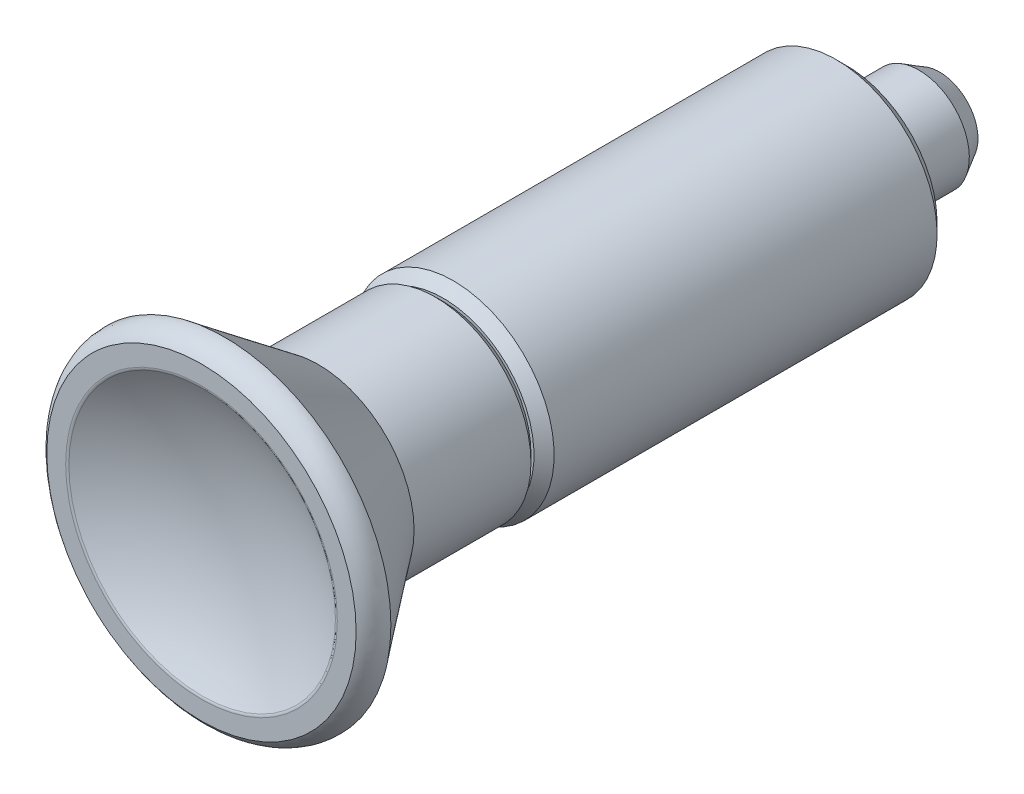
ISO-10303-21;
HEADER;
FILE_DESCRIPTION(('STEP AP214'),'2;1');
FILE_NAME('part.step','',(''),(''),'','','');
FILE_SCHEMA(('AUTOMOTIVE_DESIGN { 1 0 10303 214 1 1 1 1 }'));
ENDSEC;
DATA;
#1=APPLICATION_CONTEXT('core data for automotive mechanical design processes');
#2=APPLICATION_PROTOCOL_DEFINITION('international standard','automotive_design',2000,#1);
#3=PRODUCT_CONTEXT('',#1,'mechanical');
#4=PRODUCT('Part','Part','',(#3));
#5=PRODUCT_RELATED_PRODUCT_CATEGORY('part','',(#4));
#6=PRODUCT_DEFINITION_FORMATION('','',#4);
#7=PRODUCT_DEFINITION_CONTEXT('part definition',#1,'design');
#8=PRODUCT_DEFINITION('design','',#6,#7);
#9=PRODUCT_DEFINITION_SHAPE('','',#8);
#10=(LENGTH_UNIT() NAMED_UNIT(*) SI_UNIT(.MILLI.,.METRE.));
#11=(NAMED_UNIT(*) PLANE_ANGLE_UNIT() SI_UNIT($,.RADIAN.));
#12=(NAMED_UNIT(*) SI_UNIT($,.STERADIAN.) SOLID_ANGLE_UNIT());
#13=UNCERTAINTY_MEASURE_WITH_UNIT(LENGTH_MEASURE(1.E-05),#10,'distance_accuracy_value','');
#14=(GEOMETRIC_REPRESENTATION_CONTEXT(3) GLOBAL_UNCERTAINTY_ASSIGNED_CONTEXT((#13)) GLOBAL_UNIT_ASSIGNED_CONTEXT((#10,
#11,#12)) REPRESENTATION_CONTEXT('',''));
#15=CARTESIAN_POINT('',(0.,0.,0.));
#16=DIRECTION('',(0.,0.,1.));
#17=DIRECTION('',(1.,0.,0.));
#18=AXIS2_PLACEMENT_3D('',#15,#16,#17);
#19=CARTESIAN_POINT('',(3.05742424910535E-10,5.05678832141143E-10,-8.26498591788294E-10));
#20=DIRECTION('',(-0.923728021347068,-0.383049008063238,0.));
#21=DIRECTION('',(0.,0.,-1.));
#22=AXIS2_PLACEMENT_3D('',#19,#20,#21);
#23=SPHERICAL_SURFACE('',#22,10.);
#24=CARTESIAN_POINT('',(0.,0.,-9.24093444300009));
#25=DIRECTION('',(0.,0.,1.));
#26=DIRECTION('',(0.923728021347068,0.383049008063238,0.));
#27=AXIS2_PLACEMENT_3D('',#24,#25,#26);
#28=CIRCLE('',#27,3.82166595);
#29=CARTESIAN_POINT('',(3.53017992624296,1.46388535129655,-9.24093444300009));
#30=VERTEX_POINT('',#29);
#31=EDGE_CURVE('E39',#30,#30,#28,.T.);
#32=ORIENTED_EDGE('',*,*,#31,.F.);
#33=EDGE_LOOP('',(#32));
#34=FACE_BOUND('',#33,.T.);
#35=ADVANCED_FACE('F12',(#34),#23,.T.);
#36=CARTESIAN_POINT('',(0.,0.,-9.24093444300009));
#37=DIRECTION('',(0.,0.,1.));
#38=DIRECTION('',(0.923728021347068,0.383049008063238,0.));
#39=AXIS2_PLACEMENT_3D('',#36,#37,#38);
#40=CONICAL_SURFACE('',#39,3.82166595,0.523598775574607);
#41=CARTESIAN_POINT('',(0.,0.,-7.2));
#42=DIRECTION('',(0.,0.,-1.));
#43=DIRECTION('',(-0.923728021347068,-0.383049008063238,0.));
#44=AXIS2_PLACEMENT_3D('',#41,#42,#43);
#45=CIRCLE('',#44,5.);
#46=CARTESIAN_POINT('',(-4.61864010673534,-1.91524504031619,-7.2));
#47=VERTEX_POINT('',#46);
#48=EDGE_CURVE('E32',#47,#47,#45,.F.);
#49=ORIENTED_EDGE('',*,*,#48,.F.);
#50=EDGE_LOOP('',(#49));
#51=FACE_BOUND('',#50,.T.);
#52=ORIENTED_EDGE('',*,*,#31,.T.);
#53=EDGE_LOOP('',(#52));
#54=FACE_BOUND('',#53,.T.);
#55=ADVANCED_FACE('F80',(#51,#54),#40,.T.);
#56=CARTESIAN_POINT('',(0.,0.,0.));
#57=DIRECTION('',(0.,0.,-1.));
#58=DIRECTION('',(-0.923728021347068,-0.383049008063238,0.));
#59=AXIS2_PLACEMENT_3D('',#56,#57,#58);
#60=CYLINDRICAL_SURFACE('',#59,5.);
#61=ORIENTED_EDGE('',*,*,#48,.T.);
#62=EDGE_LOOP('',(#61));
#63=FACE_BOUND('',#62,.T.);
#64=CARTESIAN_POINT('',(0.,0.,0.));
#65=DIRECTION('',(0.,0.,-1.));
#66=DIRECTION('',(-0.923728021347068,-0.383049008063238,0.));
#67=AXIS2_PLACEMENT_3D('',#64,#65,#66);
#68=CIRCLE('',#67,5.);
#69=CARTESIAN_POINT('',(-4.61864010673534,-1.91524504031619,0.));
#70=VERTEX_POINT('',#69);
#71=EDGE_CURVE('E37',#70,#70,#68,.T.);
#72=ORIENTED_EDGE('',*,*,#71,.T.);
#73=EDGE_LOOP('',(#72));
#74=FACE_BOUND('',#73,.T.);
#75=ADVANCED_FACE('F87',(#63,#74),#60,.T.);
#76=CARTESIAN_POINT('',(-4.91249956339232,-11.9310751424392,0.));
#77=DIRECTION('',(0.,0.,1.));
#78=DIRECTION('',(0.923728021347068,0.383049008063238,0.));
#79=AXIS2_PLACEMENT_3D('',#76,#77,#78);
#80=PLANE('',#79);
#81=ORIENTED_EDGE('',*,*,#71,.F.);
#82=EDGE_LOOP('',(#81));
#83=FACE_BOUND('',#82,.T.);
#84=CARTESIAN_POINT('',(0.,0.,0.));
#85=DIRECTION('',(0.,0.,1.));
#86=DIRECTION('',(0.923728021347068,0.383049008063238,0.));
#87=AXIS2_PLACEMENT_3D('',#84,#85,#86);
#88=CIRCLE('',#87,9.);
#89=CARTESIAN_POINT('',(8.31355219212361,3.44744107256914,0.));
#90=VERTEX_POINT('',#89);
#91=EDGE_CURVE('E34',#90,#90,#88,.T.);
#92=ORIENTED_EDGE('',*,*,#91,.F.);
#93=EDGE_LOOP('',(#92));
#94=FACE_BOUND('',#93,.T.);
#95=ADVANCED_FACE('F91',(#83,#94),#80,.F.);
#96=CARTESIAN_POINT('',(0.,0.,0.));
#97=DIRECTION('',(0.,0.,1.));
#98=DIRECTION('',(0.923728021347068,0.383049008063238,0.));
#99=AXIS2_PLACEMENT_3D('',#96,#97,#98);
#100=CONICAL_SURFACE('',#99,9.,0.785398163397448);
#101=CARTESIAN_POINT('',(0.,0.,1.));
#102=DIRECTION('',(0.,0.,-1.));
#103=DIRECTION('',(-0.923728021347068,-0.383049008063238,0.));
#104=AXIS2_PLACEMENT_3D('',#101,#102,#103);
#105=CIRCLE('',#104,10.);
#106=CARTESIAN_POINT('',(-9.23728021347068,-3.83049008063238,0.999999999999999));
#107=VERTEX_POINT('',#106);
#108=EDGE_CURVE('E28',#107,#107,#105,.F.);
#109=ORIENTED_EDGE('',*,*,#108,.F.);
#110=EDGE_LOOP('',(#109));
#111=FACE_BOUND('',#110,.T.);
#112=ORIENTED_EDGE('',*,*,#91,.T.);
#113=EDGE_LOOP('',(#112));
#114=FACE_BOUND('',#113,.T.);
#115=ADVANCED_FACE('F93',(#111,#114),#100,.T.);
#116=CARTESIAN_POINT('',(0.,0.,39.));
#117=DIRECTION('',(0.,0.,-1.));
#118=DIRECTION('',(0.383049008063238,-0.923728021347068,0.));
#119=AXIS2_PLACEMENT_3D('',#116,#117,#118);
#120=CYLINDRICAL_SURFACE('',#119,10.);
#121=ORIENTED_EDGE('',*,*,#108,.T.);
#122=EDGE_LOOP('',(#121));
#123=FACE_BOUND('',#122,.T.);
#124=CARTESIAN_POINT('',(0.,0.,39.));
#125=DIRECTION('',(0.,0.,-1.));
#126=DIRECTION('',(-0.923728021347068,-0.383049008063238,0.));
#127=AXIS2_PLACEMENT_3D('',#124,#125,#126);
#128=CIRCLE('',#127,10.);
#129=CARTESIAN_POINT('',(-9.23728021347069,-3.83049008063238,39.));
#130=VERTEX_POINT('',#129);
#131=EDGE_CURVE('E23',#130,#130,#128,.F.);
#132=ORIENTED_EDGE('',*,*,#131,.F.);
#133=EDGE_LOOP('',(#132));
#134=FACE_BOUND('',#133,.T.);
#135=ADVANCED_FACE('F96',(#123,#134),#120,.T.);
#136=CARTESIAN_POINT('',(0.,0.,40.));
#137=DIRECTION('',(0.,0.,-1.));
#138=DIRECTION('',(0.383049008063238,-0.923728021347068,0.));
#139=AXIS2_PLACEMENT_3D('',#136,#137,#138);
#140=CONICAL_SURFACE('',#139,9.,0.785398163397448);
#141=ORIENTED_EDGE('',*,*,#131,.T.);
#142=EDGE_LOOP('',(#141));
#143=FACE_BOUND('',#142,.T.);
#144=CARTESIAN_POINT('',(0.,0.,40.));
#145=DIRECTION('',(0.,0.,-1.));
#146=DIRECTION('',(0.383049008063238,-0.923728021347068,0.));
#147=AXIS2_PLACEMENT_3D('',#144,#145,#146);
#148=CIRCLE('',#147,9.);
#149=CARTESIAN_POINT('',(3.44744107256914,-8.31355219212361,40.));
#150=VERTEX_POINT('',#149);
#151=EDGE_CURVE('E19',#150,#150,#148,.T.);
#152=ORIENTED_EDGE('',*,*,#151,.T.);
#153=EDGE_LOOP('',(#152));
#154=FACE_BOUND('',#153,.T.);
#155=ADVANCED_FACE('F100',(#143,#154),#140,.T.);
#156=CARTESIAN_POINT('',(11.9141300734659,-4.95345441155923,40.));
#157=DIRECTION('',(0.,0.,-1.));
#158=DIRECTION('',(-0.923728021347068,-0.383049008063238,0.));
#159=AXIS2_PLACEMENT_3D('',#156,#157,#158);
#160=PLANE('',#159);
#161=CARTESIAN_POINT('',(0.,0.,40.));
#162=DIRECTION('',(0.,0.,-1.));
#163=DIRECTION('',(-1.,0.,0.));
#164=AXIS2_PLACEMENT_3D('',#161,#162,#163);
#165=CIRCLE('',#164,8.7);
#166=CARTESIAN_POINT('',(-8.70000000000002,0.,40.));
#167=VERTEX_POINT('',#166);
#168=EDGE_CURVE('E8',#167,#167,#165,.T.);
#169=ORIENTED_EDGE('',*,*,#168,.T.);
#170=EDGE_LOOP('',(#169));
#171=FACE_BOUND('',#170,.T.);
#172=ORIENTED_EDGE('',*,*,#151,.F.);
#173=EDGE_LOOP('',(#172));
#174=FACE_BOUND('',#173,.T.);
#175=ADVANCED_FACE('F14',(#171,#174),#160,.F.);
#176=CARTESIAN_POINT('',(-7.38649893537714E-13,0.,86.3153369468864));
#177=DIRECTION('',(0.,0.,-1.));
#178=DIRECTION('',(1.,0.,0.));
#179=AXIS2_PLACEMENT_3D('',#176,#177,#178);
#180=SPHERICAL_SURFACE('',#179,25.9999999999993);
#181=CARTESIAN_POINT('',(0.,0.,63.9304780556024));
#182=DIRECTION('',(0.,0.,-1.));
#183=DIRECTION('',(1.,0.,0.));
#184=AXIS2_PLACEMENT_3D('',#181,#182,#183);
#185=CIRCLE('',#184,13.2256603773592);
#186=CARTESIAN_POINT('',(13.2256603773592,0.,63.9304780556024));
#187=VERTEX_POINT('',#186);
#188=EDGE_CURVE('E71',#187,#187,#185,.T.);
#189=ORIENTED_EDGE('',*,*,#188,.F.);
#190=EDGE_LOOP('',(#189));
#191=FACE_BOUND('',#190,.T.);
#192=ADVANCED_FACE('F83',(#191),#180,.F.);
#193=CARTESIAN_POINT('',(13.2256603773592,0.,63.9304780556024));
#194=CARTESIAN_POINT('',(13.3433285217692,0.,64.0000000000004));
#195=CARTESIAN_POINT('',(13.48,0.,64.));
#196=CARTESIAN_POINT('',(13.2256603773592,-22.9075157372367,63.9304780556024));
#197=CARTESIAN_POINT('',(13.3433285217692,-23.1113229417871,64.0000000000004));
#198=CARTESIAN_POINT('',(13.48,-23.3480448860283,64.));
#199=CARTESIAN_POINT('',(-6.61283018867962,-11.4537578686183,63.9304780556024));
#200=CARTESIAN_POINT('',(-6.67166426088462,-11.5556614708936,64.0000000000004));
#201=CARTESIAN_POINT('',(-6.74,-11.6740224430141,64.));
#202=CARTESIAN_POINT('',(-26.4513207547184,0.,63.9304780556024));
#203=CARTESIAN_POINT('',(-26.6866570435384,0.,64.0000000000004));
#204=CARTESIAN_POINT('',(-26.96,0.,64.));
#205=CARTESIAN_POINT('',(-6.61283018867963,11.4537578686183,63.9304780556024));
#206=CARTESIAN_POINT('',(-6.67166426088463,11.5556614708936,64.0000000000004));
#207=CARTESIAN_POINT('',(-6.74,11.6740224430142,64.));
#208=CARTESIAN_POINT('',(13.2256603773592,22.9075157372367,63.9304780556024));
#209=CARTESIAN_POINT('',(13.3433285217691,23.1113229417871,64.0000000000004));
#210=CARTESIAN_POINT('',(13.48,23.3480448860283,64.));
#211=CARTESIAN_POINT('',(13.2256603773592,0.,63.9304780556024));
#212=CARTESIAN_POINT('',(13.3433285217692,0.,64.0000000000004));
#213=CARTESIAN_POINT('',(13.48,0.,64.));
#214=(BOUNDED_SURFACE() B_SPLINE_SURFACE(2,2,((#193,#194,#195),(#196,#197,#198),(#199,#200,
#201),(#202,#203,#204),(#205,#206,#207),(#208,#209,#210),(#211,#212,#213)),.UNSPECIFIED.,.T.,
.F.,.F.) B_SPLINE_SURFACE_WITH_KNOTS((3,2,2,3),(3,3),(0.,169.162579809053,338.325159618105,
507.487739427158),(0.,1.),
.UNSPECIFIED.) GEOMETRIC_REPRESENTATION_ITEM() RATIONAL_B_SPLINE_SURFACE(((1.,0.964612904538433,
1.),(0.5,0.482306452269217,0.5),(1.,0.964612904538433,1.),(0.5,0.482306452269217,0.5),(1.,
0.964612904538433,1.),(0.5,0.482306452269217,0.5),(1.,0.964612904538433,1.))) REPRESENTATION_ITEM('') SURFACE());
#215=CARTESIAN_POINT('',(0.,0.,64.));
#216=DIRECTION('',(0.,0.,-1.));
#217=DIRECTION('',(1.,0.,0.));
#218=AXIS2_PLACEMENT_3D('',#215,#216,#217);
#219=CIRCLE('',#218,13.48);
#220=CARTESIAN_POINT('',(13.48,0.,64.));
#221=VERTEX_POINT('',#220);
#222=EDGE_CURVE('E64',#221,#221,#219,.T.);
#223=CARTESIAN_POINT('',(13.2256603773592,0.,63.9304780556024));
#224=CARTESIAN_POINT('',(13.2280276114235,0.,63.9318766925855));
#225=CARTESIAN_POINT('',(13.2304063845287,0.,63.933255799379));
#226=CARTESIAN_POINT('',(13.2351913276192,0.,63.9359774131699));
#227=CARTESIAN_POINT('',(13.2375975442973,0.,63.937319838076));
#228=CARTESIAN_POINT('',(13.2424365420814,0.,63.9399672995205));
#229=CARTESIAN_POINT('',(13.2448693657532,0.,63.9412722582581));
#230=CARTESIAN_POINT('',(13.249760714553,0.,63.9438440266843));
#231=CARTESIAN_POINT('',(13.25221927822,0.,63.9451107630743));
#232=CARTESIAN_POINT('',(13.2571612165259,0.,63.9476053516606));
#233=CARTESIAN_POINT('',(13.2596446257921,0.,63.9488331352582));
#234=CARTESIAN_POINT('',(13.2646353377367,0.,63.9512491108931));
#235=CARTESIAN_POINT('',(13.2671426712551,0.,63.9524372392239));
#236=CARTESIAN_POINT('',(13.2721802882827,0.,63.9547732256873));
#237=CARTESIAN_POINT('',(13.2747105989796,0.,63.9559210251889));
#238=CARTESIAN_POINT('',(13.2797932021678,0.,63.9581757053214));
#239=CARTESIAN_POINT('',(13.2823455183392,0.,63.9592825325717));
#240=CARTESIAN_POINT('',(13.2874711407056,0.,63.9614546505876));
#241=CARTESIAN_POINT('',(13.2900444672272,0.,63.9625198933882));
#242=CARTESIAN_POINT('',(13.2952110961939,0.,63.9646082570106));
#243=CARTESIAN_POINT('',(13.297804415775,0.,63.9656313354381));
#244=CARTESIAN_POINT('',(13.3030099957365,0.,63.9676348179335));
#245=CARTESIAN_POINT('',(13.3056222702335,0.,63.9686151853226));
#246=CARTESIAN_POINT('',(13.3108647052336,0.,63.9705327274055));
#247=CARTESIAN_POINT('',(13.3134948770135,0.,63.9714698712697));
#248=CARTESIAN_POINT('',(13.3187720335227,0.,63.9733004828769));
#249=CARTESIAN_POINT('',(13.3214190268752,0.,63.9741939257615));
#250=CARTESIAN_POINT('',(13.3267287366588,0.,63.975936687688));
#251=CARTESIAN_POINT('',(13.329391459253,0.,63.9767859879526));
#252=CARTESIAN_POINT('',(13.3347315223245,0.,63.9784400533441));
#253=CARTESIAN_POINT('',(13.3374088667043,0.,63.9792448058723));
#254=CARTESIAN_POINT('',(13.3427770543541,0.,63.9808094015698));
#255=CARTESIAN_POINT('',(13.3454678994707,0.,63.9815692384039));
#256=CARTESIAN_POINT('',(13.3508619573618,0.,63.9830436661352));
#257=CARTESIAN_POINT('',(13.3535651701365,0.,63.9837582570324));
#258=CARTESIAN_POINT('',(13.3589828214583,0.,63.9851418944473));
#259=CARTESIAN_POINT('',(13.3616972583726,0.,63.9858109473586));
#260=CARTESIAN_POINT('',(13.3671362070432,0.,63.9871032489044));
#261=CARTESIAN_POINT('',(13.3698607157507,0.,63.9877265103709));
#262=CARTESIAN_POINT('',(13.3753186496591,0.,63.9889270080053));
#263=CARTESIAN_POINT('',(13.3780520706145,0.,63.9895042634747));
#264=CARTESIAN_POINT('',(13.3835266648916,0.,63.9906125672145));
#265=CARTESIAN_POINT('',(13.3862678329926,0.,63.9911436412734));
#266=CARTESIAN_POINT('',(13.3917567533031,0.,63.992159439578));
#267=CARTESIAN_POINT('',(13.394504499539,0.,63.9926441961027));
#268=CARTESIAN_POINT('',(13.4000054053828,0.,63.9935672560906));
#269=CARTESIAN_POINT('',(13.4027585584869,0.,63.9940055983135));
#270=CARTESIAN_POINT('',(13.4082691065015,0.,63.9948357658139));
#271=CARTESIAN_POINT('',(13.4110264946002,0.,63.9952276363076));
#272=CARTESIAN_POINT('',(13.4165443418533,0.,63.9959648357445));
#273=CARTESIAN_POINT('',(13.4193047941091,0.,63.9963102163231));
#274=CARTESIAN_POINT('',(13.4248276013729,0.,63.996954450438));
#275=CARTESIAN_POINT('',(13.4275899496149,0.,63.9972533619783));
#276=CARTESIAN_POINT('',(13.4331153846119,0.,63.9978047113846));
#277=CARTESIAN_POINT('',(13.43587846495,0.,63.9980572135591));
#278=CARTESIAN_POINT('',(13.4414042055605,0.,63.9985158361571));
#279=CARTESIAN_POINT('',(13.4441668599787,0.,63.9987220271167));
#280=CARTESIAN_POINT('',(13.4496905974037,0.,63.9990881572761));
#281=CARTESIAN_POINT('',(13.4524516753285,0.,63.9992481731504));
#282=CARTESIAN_POINT('',(13.4579711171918,0.,63.9995221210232));
#283=CARTESIAN_POINT('',(13.4607294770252,0.,63.9996361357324));
#284=CARTESIAN_POINT('',(13.466242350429,0.,63.9998182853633));
#285=CARTESIAN_POINT('',(13.4689968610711,0.,63.9998865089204));
#286=CARTESIAN_POINT('',(13.4745009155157,0.,63.9999773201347));
#287=CARTESIAN_POINT('',(13.4772504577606,0.,64.0000000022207));
#288=CARTESIAN_POINT('',(13.48,0.,64.));
#289=B_SPLINE_CURVE_WITH_KNOTS('',3,(#223,#224,#225,#226,#227,#228,#229,#230,#231,#232,#233,
#234,#235,#236,#237,#238,#239,#240,#241,#242,#243,#244,#245,#246,#247,#248,#249,#250,#251,#252,
#253,#254,#255,#256,#257,#258,#259,#260,#261,#262,#263,#264,#265,#266,#267,#268,#269,#270,#271,
#272,#273,#274,#275,#276,#277,#278,#279,#280,#281,#282,#283,#284,#285,#286,#287,#288),
.UNSPECIFIED.,.F.,.F.,(4,2,2,2,2,2,2,2,2,2,2,2,2,2,2,2,2,2,2,2,2,2,2,2,2,2,2,2,2,2,2,2,4),(0.,
0.00824853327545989,0.0165142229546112,0.0247959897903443,0.0330927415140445,0.0414033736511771,
0.0497267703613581,0.0580618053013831,0.0664073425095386,0.0747622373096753,0.083125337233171,
0.0914954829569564,0.0998715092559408,0.108252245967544,0.116636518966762,0.125023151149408,
0.1334109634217,0.141798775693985,0.150185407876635,0.15856968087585,0.166950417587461,
0.175326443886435,0.183696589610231,0.192059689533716,0.200414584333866,0.208760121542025,
0.217095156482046,0.225418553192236,0.233729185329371,0.242025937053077,0.250307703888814,
0.258573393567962,0.266821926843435),.UNSPECIFIED.);
#290=EDGE_CURVE('BSEAM117',#187,#221,#289,.T.);
#291=ORIENTED_EDGE('',*,*,#188,.T.);
#292=ORIENTED_EDGE('',*,*,#222,.F.);
#293=ORIENTED_EDGE('',*,*,#290,.T.);
#294=ORIENTED_EDGE('',*,*,#290,.F.);
#295=EDGE_LOOP('',(#291,#293,#292,#294));
#296=FACE_BOUND('',#295,.T.);
#297=ADVANCED_FACE('F117',(#296),#214,.T.);
#298=CARTESIAN_POINT('',(-16.885,-16.885,64.));
#299=DIRECTION('',(0.,0.,1.));
#300=DIRECTION('',(1.,0.,0.));
#301=AXIS2_PLACEMENT_3D('',#298,#299,#300);
#302=PLANE('',#301);
#303=CARTESIAN_POINT('',(0.,0.,64.));
#304=DIRECTION('',(0.,0.,-1.));
#305=DIRECTION('',(1.,0.,0.));
#306=AXIS2_PLACEMENT_3D('',#303,#304,#305);
#307=CIRCLE('',#306,15.35);
#308=CARTESIAN_POINT('',(15.35,0.,64.));
#309=VERTEX_POINT('',#308);
#310=EDGE_CURVE('E57',#309,#309,#307,.T.);
#311=ORIENTED_EDGE('',*,*,#310,.F.);
#312=EDGE_LOOP('',(#311));
#313=FACE_BOUND('',#312,.T.);
#314=ORIENTED_EDGE('',*,*,#222,.T.);
#315=EDGE_LOOP('',(#314));
#316=FACE_BOUND('',#315,.T.);
#317=ADVANCED_FACE('F124',(#313,#316),#302,.T.);
#318=CARTESIAN_POINT('',(15.35,0.,64.));
#319=CARTESIAN_POINT('',(16.6156543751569,0.,63.1898669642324));
#320=CARTESIAN_POINT('',(16.5,0.,61.7));
#321=CARTESIAN_POINT('',(15.35,-26.5869798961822,64.));
#322=CARTESIAN_POINT('',(16.6156543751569,-28.779157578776,63.1898669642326));
#323=CARTESIAN_POINT('',(16.5,-28.5788383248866,61.7));
#324=CARTESIAN_POINT('',(-7.675,-13.2934899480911,64.));
#325=CARTESIAN_POINT('',(-8.30782718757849,-14.389578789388,63.1898669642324));
#326=CARTESIAN_POINT('',(-8.25,-14.2894191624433,61.7));
#327=CARTESIAN_POINT('',(-30.7,0.,64.));
#328=CARTESIAN_POINT('',(-33.2313087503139,0.,63.1898669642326));
#329=CARTESIAN_POINT('',(-33.,0.,61.7));
#330=CARTESIAN_POINT('',(-7.675,13.2934899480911,64.));
#331=CARTESIAN_POINT('',(-8.30782718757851,14.389578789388,63.1898669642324));
#332=CARTESIAN_POINT('',(-8.25,14.2894191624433,61.7));
#333=CARTESIAN_POINT('',(15.35,26.5869798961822,64.));
#334=CARTESIAN_POINT('',(16.6156543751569,28.779157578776,63.1898669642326));
#335=CARTESIAN_POINT('',(16.5,28.5788383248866,61.7));
#336=CARTESIAN_POINT('',(15.35,0.,64.));
#337=CARTESIAN_POINT('',(16.6156543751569,0.,63.1898669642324));
#338=CARTESIAN_POINT('',(16.5,0.,61.7));
#339=(BOUNDED_SURFACE() B_SPLINE_SURFACE(2,2,((#318,#319,#320),(#321,#322,#323),(#324,#325,
#326),(#327,#328,#329),(#330,#331,#332),(#333,#334,#335),(#336,#337,#338)),.UNSPECIFIED.,.T.,
.F.,.F.) B_SPLINE_SURFACE_WITH_KNOTS((3,2,2,3),(3,3),(0.,18.7749492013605,37.5498984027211,
56.3248476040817),(0.,1.),
.UNSPECIFIED.) GEOMETRIC_REPRESENTATION_ITEM() RATIONAL_B_SPLINE_SURFACE(((1.,0.857079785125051,
1.),(0.5,0.428539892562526,0.5),(1.,0.857079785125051,1.),(0.5,0.428539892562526,0.5),(1.,
0.857079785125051,1.),(0.5,0.428539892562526,0.5),(1.,0.857079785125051,1.))) REPRESENTATION_ITEM('') SURFACE());
#340=CARTESIAN_POINT('',(0.,0.,61.7));
#341=DIRECTION('',(0.,0.,1.));
#342=DIRECTION('',(1.,0.,0.));
#343=AXIS2_PLACEMENT_3D('',#340,#341,#342);
#344=CIRCLE('',#343,16.5);
#345=CARTESIAN_POINT('',(16.5,0.,61.7));
#346=VERTEX_POINT('',#345);
#347=EDGE_CURVE('E60',#346,#346,#344,.T.);
#348=CARTESIAN_POINT('',(15.35,0.,64.));
#349=CARTESIAN_POINT('',(15.3556561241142,0.,63.9963795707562));
#350=CARTESIAN_POINT('',(15.3612977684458,0.,63.992736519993));
#351=CARTESIAN_POINT('',(15.3725641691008,0.,63.9853973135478));
#352=CARTESIAN_POINT('',(15.3781888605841,0.,63.9817010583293));
#353=CARTESIAN_POINT('',(15.3894206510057,0.,63.9742554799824));
#354=CARTESIAN_POINT('',(15.395027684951,0.,63.9705060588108));
#355=CARTESIAN_POINT('',(15.4062234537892,0.,63.9629541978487));
#356=CARTESIAN_POINT('',(15.4118121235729,0.,63.9591516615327));
#357=CARTESIAN_POINT('',(15.4229704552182,0.,63.9514936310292));
#358=CARTESIAN_POINT('',(15.4285400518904,0.,63.9476380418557));
#359=CARTESIAN_POINT('',(15.4396595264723,0.,63.9398739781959));
#360=CARTESIAN_POINT('',(15.4452093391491,0.,63.9359654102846));
#361=CARTESIAN_POINT('',(15.4562885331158,0.,63.9280954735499));
#362=CARTESIAN_POINT('',(15.4618178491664,0.,63.9241340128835));
#363=CARTESIAN_POINT('',(15.4728553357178,0.,63.9161583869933));
#364=CARTESIAN_POINT('',(15.4783634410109,0.,63.9121441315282));
#365=CARTESIAN_POINT('',(15.489357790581,0.,63.9040630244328));
#366=CARTESIAN_POINT('',(15.4948439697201,0.,63.8999960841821));
#367=CARTESIAN_POINT('',(15.5057937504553,0.,63.8918097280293));
#368=CARTESIAN_POINT('',(15.5112572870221,0.,63.8876902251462));
#369=CARTESIAN_POINT('',(15.5221610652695,0.,63.8793988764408));
#370=CARTESIAN_POINT('',(15.527601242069,0.,63.8752269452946));
#371=CARTESIAN_POINT('',(15.538457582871,0.,63.8668308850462));
#372=CARTESIAN_POINT('',(15.5438736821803,0.,63.8626066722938));
#373=CARTESIAN_POINT('',(15.5546811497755,0.,63.8541062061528));
#374=CARTESIAN_POINT('',(15.5600724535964,0.,63.8498298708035));
#375=CARTESIAN_POINT('',(15.5708296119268,0.,63.8412253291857));
#376=CARTESIAN_POINT('',(15.5761954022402,0.,63.8368970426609));
#377=CARTESIAN_POINT('',(15.5869008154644,0.,63.8281887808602));
#378=CARTESIAN_POINT('',(15.592240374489,0.,63.8238087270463));
#379=CARTESIAN_POINT('',(15.6028926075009,0.,63.8149971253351));
#380=CARTESIAN_POINT('',(15.6082052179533,0.,63.810565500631));
#381=CARTESIAN_POINT('',(15.6188028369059,0.,63.8016509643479));
#382=CARTESIAN_POINT('',(15.6240877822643,0.,63.7971679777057));
#383=CARTESIAN_POINT('',(15.634629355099,0.,63.7881509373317));
#384=CARTESIAN_POINT('',(15.6398859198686,0.,63.783616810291));
#385=CARTESIAN_POINT('',(15.6503700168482,0.,63.7744977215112));
#386=CARTESIAN_POINT('',(15.655597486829,0.,63.7699126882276));
#387=CARTESIAN_POINT('',(15.6660226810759,0.,63.7606920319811));
#388=CARTESIAN_POINT('',(15.6712203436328,0.,63.7560563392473));
#389=CARTESIAN_POINT('',(15.6815852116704,0.,63.7467346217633));
#390=CARTESIAN_POINT('',(15.6867523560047,0.,63.742048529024));
#391=CARTESIAN_POINT('',(15.6970554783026,0.,63.732626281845));
#392=CARTESIAN_POINT('',(15.7021913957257,0.,63.7278900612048));
#393=CARTESIAN_POINT('',(15.7124313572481,0.,63.7183678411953));
#394=CARTESIAN_POINT('',(15.717535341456,0.,63.71358177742));
#395=CARTESIAN_POINT('',(15.7277107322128,0.,63.7039601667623));
#396=CARTESIAN_POINT('',(15.7327820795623,0.,63.6991245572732));
#397=CARTESIAN_POINT('',(15.7428914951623,0.,63.689404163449));
#398=CARTESIAN_POINT('',(15.7479295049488,0.,63.6845193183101));
#399=CARTESIAN_POINT('',(15.7579715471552,0.,63.6747007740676));
#400=CARTESIAN_POINT('',(15.7629755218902,0.,63.6697670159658));
#401=CARTESIAN_POINT('',(15.7729487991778,0.,63.6598509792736));
#402=CARTESIAN_POINT('',(15.7779180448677,0.,63.6548686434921));
#403=CARTESIAN_POINT('',(15.7878211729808,0.,63.6448557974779));
#404=CARTESIAN_POINT('',(15.7927549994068,0.,63.6398252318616));
#405=CARTESIAN_POINT('',(15.8025866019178,0.,63.6297162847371));
#406=CARTESIAN_POINT('',(15.8074843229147,0.,63.6246378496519));
#407=CARTESIAN_POINT('',(15.817243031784,0.,63.6144335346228));
#408=CARTESIAN_POINT('',(15.8221039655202,0.,63.6093076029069));
#409=CARTESIAN_POINT('',(15.8317884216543,0.,63.5990086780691));
#410=CARTESIAN_POINT('',(15.8366118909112,0.,63.5938356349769));
#411=CARTESIAN_POINT('',(15.8462207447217,0.,63.5834428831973));
#412=CARTESIAN_POINT('',(15.8510060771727,0.,63.5782231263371));
#413=CARTESIAN_POINT('',(15.8605379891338,0.,63.5677373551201));
#414=CARTESIAN_POINT('',(15.8652845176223,0.,63.5624712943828));
#415=CARTESIAN_POINT('',(15.8747381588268,0.,63.5518933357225));
#416=CARTESIAN_POINT('',(15.8794452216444,0.,63.5465813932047));
#417=CARTESIAN_POINT('',(15.8888192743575,0.,63.535912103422));
#418=CARTESIAN_POINT('',(15.8934862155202,0.,63.5305547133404));
#419=CARTESIAN_POINT('',(15.9027793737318,0.,63.5197949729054));
#420=CARTESIAN_POINT('',(15.9074055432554,0.,63.5143925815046));
#421=CARTESIAN_POINT('',(15.9166165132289,0.,63.5035432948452));
#422=CARTESIAN_POINT('',(15.9212012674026,0.,63.4980963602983));
#423=CARTESIAN_POINT('',(15.9303287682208,0.,63.4871584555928));
#424=CARTESIAN_POINT('',(15.9348714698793,0.,63.4816674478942));
#425=CARTESIAN_POINT('',(15.9439142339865,0.,63.4706418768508));
#426=CARTESIAN_POINT('',(15.9484142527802,0.,63.4651072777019));
#427=CARTESIAN_POINT('',(15.9573710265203,0.,63.4539950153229));
#428=CARTESIAN_POINT('',(15.9618277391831,0.,63.448417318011));
#429=CARTESIAN_POINT('',(15.9706972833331,0.,63.4372193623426));
#430=CARTESIAN_POINT('',(15.9751100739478,0.,63.4315990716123));
#431=CARTESIAN_POINT('',(15.9838911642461,0.,63.4203164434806));
#432=CARTESIAN_POINT('',(15.9882594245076,0.,63.4146540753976));
#433=CARTESIAN_POINT('',(15.9969508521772,0.,63.4032878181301));
#434=CARTESIAN_POINT('',(16.0012739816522,0.,63.3975838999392));
#435=CARTESIAN_POINT('',(16.0098745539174,0.,63.3861350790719));
#436=CARTESIAN_POINT('',(16.0141519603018,0.,63.3803901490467));
#437=CARTESIAN_POINT('',(16.0226605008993,0.,63.3688598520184));
#438=CARTESIAN_POINT('',(16.0268916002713,0.,63.3630744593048));
#439=CARTESIAN_POINT('',(16.035306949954,0.,63.3514637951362));
#440=CARTESIAN_POINT('',(16.0394911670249,0.,63.3456384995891));
#441=CARTESIAN_POINT('',(16.0478121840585,0.,63.3339485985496));
#442=CARTESIAN_POINT('',(16.0519489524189,0.,63.3280839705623));
#443=CARTESIAN_POINT('',(16.0601745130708,0.,63.3163159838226));
#444=CARTESIAN_POINT('',(16.0642632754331,0.,63.3104126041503));
#445=CARTESIAN_POINT('',(16.072392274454,0.,63.2985677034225));
#446=CARTESIAN_POINT('',(16.0764324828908,0.,63.2926261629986));
#447=CARTESIAN_POINT('',(16.0844638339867,0.,63.2807055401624));
#448=CARTESIAN_POINT('',(16.088454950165,0.,63.274726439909));
#449=CARTESIAN_POINT('',(16.0963875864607,0.,63.2627313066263));
#450=CARTESIAN_POINT('',(16.1003290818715,0.,63.256715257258));
#451=CARTESIAN_POINT('',(16.1081619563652,0.,63.2446468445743));
#452=CARTESIAN_POINT('',(16.1120533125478,0.,63.2385944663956));
#453=CARTESIAN_POINT('',(16.1197853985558,0.,63.2264540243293));
#454=CARTESIAN_POINT('',(16.1236261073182,0.,63.2203659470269));
#455=CARTESIAN_POINT('',(16.131256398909,0.,63.208154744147));
#456=CARTESIAN_POINT('',(16.1350459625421,0.,63.2020316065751));
#457=CARTESIAN_POINT('',(16.1425734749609,0.,63.189750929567));
#458=CARTESIAN_POINT('',(16.1463114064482,0.,63.1835933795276));
#459=CARTESIAN_POINT('',(16.15373517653,0.,63.1712445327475));
#460=CARTESIAN_POINT('',(16.1574209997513,0.,63.1650532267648));
#461=CARTESIAN_POINT('',(16.1647400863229,0.,63.1526375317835));
#462=CARTESIAN_POINT('',(16.1683733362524,0.,63.1464131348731));
#463=CARTESIAN_POINT('',(16.175586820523,0.,63.1339319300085));
#464=CARTESIAN_POINT('',(16.1791670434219,0.,63.1276751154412));
#465=CARTESIAN_POINT('',(16.1862740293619,0.,63.1151297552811));
#466=CARTESIAN_POINT('',(16.1898007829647,0.,63.1088412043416));
#467=CARTESIAN_POINT('',(16.196800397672,0.,63.0962330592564));
#468=CARTESIAN_POINT('',(16.2002732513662,0.,63.0899134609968));
#469=CARTESIAN_POINT('',(16.2071646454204,0.,63.0772439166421));
#470=CARTESIAN_POINT('',(16.210583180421,0.,63.0708939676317));
#471=CARTESIAN_POINT('',(16.2173655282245,0.,63.0581644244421));
#472=CARTESIAN_POINT('',(16.2207293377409,0.,63.0517848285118));
#473=CARTESIAN_POINT('',(16.2274018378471,0.,63.038996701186));
#474=CARTESIAN_POINT('',(16.2307105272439,0.,63.032588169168));
#475=CARTESIAN_POINT('',(16.237272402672,0.,63.0197428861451));
#476=CARTESIAN_POINT('',(16.2405255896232,0.,63.01330613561));
#477=CARTESIAN_POINT('',(16.2469760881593,0.,63.0004051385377));
#478=CARTESIAN_POINT('',(16.2501734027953,0.,62.993940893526));
#479=CARTESIAN_POINT('',(16.2565117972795,0.,62.9809856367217));
#480=CARTESIAN_POINT('',(16.2596528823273,0.,62.9744946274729));
#481=CARTESIAN_POINT('',(16.2658784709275,0.,62.9614865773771));
#482=CARTESIAN_POINT('',(16.2689629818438,0.,62.9549695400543));
#483=CARTESIAN_POINT('',(16.275075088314,0.,62.9419101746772));
#484=CARTESIAN_POINT('',(16.2781026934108,0.,62.9353678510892));
#485=CARTESIAN_POINT('',(16.2841006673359,0.,62.9222586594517));
#486=CARTESIAN_POINT('',(16.2870710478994,0.,62.9156917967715));
#487=CARTESIAN_POINT('',(16.2929542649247,0.,62.9025342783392));
#488=CARTESIAN_POINT('',(16.2958671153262,0.,62.89594362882));
#489=CARTESIAN_POINT('',(16.3016349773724,0.,62.8827392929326));
#490=CARTESIAN_POINT('',(16.3044900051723,0.,62.8761256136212));
#491=CARTESIAN_POINT('',(16.3101419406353,0.,62.8628759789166));
#492=CARTESIAN_POINT('',(16.3129388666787,0.,62.856240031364));
#493=CARTESIAN_POINT('',(16.3184743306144,0.,62.8429466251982));
#494=CARTESIAN_POINT('',(16.3212128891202,0.,62.8362891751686));
#495=CARTESIAN_POINT('',(16.3266313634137,0.,62.8229535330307));
#496=CARTESIAN_POINT('',(16.3293113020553,0.,62.8162753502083));
#497=CARTESIAN_POINT('',(16.3346122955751,0.,62.8028990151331));
#498=CARTESIAN_POINT('',(16.3372333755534,0.,62.7962008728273));
#499=CARTESIAN_POINT('',(16.3424164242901,0.,62.7827853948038));
#500=CARTESIAN_POINT('',(16.3449784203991,0.,62.7760680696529));
#501=CARTESIAN_POINT('',(16.3500430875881,0.,62.7626150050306));
#502=CARTESIAN_POINT('',(16.3525457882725,0.,62.7558792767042));
#503=CARTESIAN_POINT('',(16.357491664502,0.,62.7423901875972));
#504=CARTESIAN_POINT('',(16.3599348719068,0.,62.7356368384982));
#505=CARTESIAN_POINT('',(16.364761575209,0.,62.7221132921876));
#506=CARTESIAN_POINT('',(16.367145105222,0.,62.7153431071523));
#507=CARTESIAN_POINT('',(16.3718522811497,0.,62.7017866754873));
#508=CARTESIAN_POINT('',(16.3741759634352,0.,62.6950004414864));
#509=CARTESIAN_POINT('',(16.3787632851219,0.,62.6814127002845));
#510=CARTESIAN_POINT('',(16.3810269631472,0.,62.6746112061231));
#511=CARTESIAN_POINT('',(16.3854941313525,0.,62.6609937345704));
#512=CARTESIAN_POINT('',(16.3876976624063,0.,62.6541777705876));
#513=CARTESIAN_POINT('',(16.3920444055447,0.,62.6405321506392));
#514=CARTESIAN_POINT('',(16.3941876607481,0.,62.6337025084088));
#515=CARTESIAN_POINT('',(16.3984137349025,0.,62.6200303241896));
#516=CARTESIAN_POINT('',(16.4004965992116,0.,62.6131877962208));
#517=CARTESIAN_POINT('',(16.404601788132,0.,62.5994906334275));
#518=CARTESIAN_POINT('',(16.4066241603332,0.,62.5926360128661));
#519=CARTESIAN_POINT('',(16.4106082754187,0.,62.5789154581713));
#520=CARTESIAN_POINT('',(16.4125700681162,0.,62.5720495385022));
#521=CARTESIAN_POINT('',(16.4164329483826,0.,62.5583071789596));
#522=CARTESIAN_POINT('',(16.4183340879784,0.,62.5514307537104));
#523=CARTESIAN_POINT('',(16.4220756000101,0.,62.5376681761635));
#524=CARTESIAN_POINT('',(16.4239160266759,0.,62.5307820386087));
#525=CARTESIAN_POINT('',(16.4275360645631,0.,62.5170008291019));
#526=CARTESIAN_POINT('',(16.429315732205,0.,62.5101057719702));
#527=CARTESIAN_POINT('',(16.4328142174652,0.,62.4963075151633));
#528=CARTESIAN_POINT('',(16.4345330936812,0.,62.4894043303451));
#529=CARTESIAN_POINT('',(16.4379099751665,0.,62.4755906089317));
#530=CARTESIAN_POINT('',(16.4395680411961,0.,62.4686800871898));
#531=CARTESIAN_POINT('',(16.4428232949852,0.,62.4548524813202));
#532=CARTESIAN_POINT('',(16.4444205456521,0.,62.447935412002));
#533=CARTESIAN_POINT('',(16.4475541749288,0.,62.4340954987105));
#534=CARTESIAN_POINT('',(16.4490906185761,0.,62.4271726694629));
#535=CARTESIAN_POINT('',(16.4521026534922,0.,62.4133220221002));
#536=CARTESIAN_POINT('',(16.4535783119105,0.,62.4063942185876));
#537=CARTESIAN_POINT('',(16.4564688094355,0.,62.3925344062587));
#538=CARTESIAN_POINT('',(16.4578837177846,0.,62.385602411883));
#539=CARTESIAN_POINT('',(16.4606527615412,0.,62.3717349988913));
#540=CARTESIAN_POINT('',(16.4620069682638,0.,62.3647995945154));
#541=CARTESIAN_POINT('',(16.4646546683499,0.,62.3509261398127));
#542=CARTESIAN_POINT('',(16.4659482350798,0.,62.3439881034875));
#543=CARTESIAN_POINT('',(16.4684747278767,0.,62.3301101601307));
#544=CARTESIAN_POINT('',(16.4697077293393,0.,62.3231702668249));
#545=CARTESIAN_POINT('',(16.4721131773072,0.,62.3092893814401));
#546=CARTESIAN_POINT('',(16.4732857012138,0.,62.3023484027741));
#547=CARTESIAN_POINT('',(16.4755702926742,0.,62.2884661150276));
#548=CARTESIAN_POINT('',(16.4766824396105,0.,62.2815248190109));
#549=CARTESIAN_POINT('',(16.4788463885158,0.,62.2676426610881));
#550=CARTESIAN_POINT('',(16.4798982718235,0.,62.260701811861));
#551=CARTESIAN_POINT('',(16.4819418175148,0.,62.2468213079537));
#552=CARTESIAN_POINT('',(16.4829335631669,0.,62.2398816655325));
#553=CARTESIAN_POINT('',(16.4848569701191,0.,62.2260043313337));
#554=CARTESIAN_POINT('',(16.4857887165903,0.,62.2190666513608));
#555=CARTESIAN_POINT('',(16.487592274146,0.,62.2051939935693));
#556=CARTESIAN_POINT('',(16.4884641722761,0.,62.1982590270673));
#557=CARTESIAN_POINT('',(16.4901481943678,0.,62.1843925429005));
#558=CARTESIAN_POINT('',(16.4909604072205,0.,62.1774610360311));
#559=CARTESIAN_POINT('',(16.4925252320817,0.,62.1636022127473));
#560=CARTESIAN_POINT('',(16.4932779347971,0.,62.1566749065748));
#561=CARTESIAN_POINT('',(16.4947239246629,0.,62.1428252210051));
#562=CARTESIAN_POINT('',(16.4954173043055,0.,62.1359028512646));
#563=CARTESIAN_POINT('',(16.4967448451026,0.,62.1220637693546));
#564=CARTESIAN_POINT('',(16.4973791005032,0.,62.1151470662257));
#565=CARTESIAN_POINT('',(16.4985886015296,0.,62.101320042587));
#566=CARTESIAN_POINT('',(16.4991639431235,0.,62.0944097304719));
#567=CARTESIAN_POINT('',(16.5002558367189,0.,62.0805962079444));
#568=CARTESIAN_POINT('',(16.5007724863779,0.,62.0736930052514));
#569=CARTESIAN_POINT('',(16.5017472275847,0.,62.0598944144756));
#570=CARTESIAN_POINT('',(16.5022054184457,0.,62.0529990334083));
#571=CARTESIAN_POINT('',(16.5030634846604,0.,62.0392167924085));
#572=CARTESIAN_POINT('',(16.503463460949,0.,62.0323299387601));
#573=CARTESIAN_POINT('',(16.5042053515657,0.,62.0185654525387));
#574=CARTESIAN_POINT('',(16.5045473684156,0.,62.0116878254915));
#575=CARTESIAN_POINT('',(16.5051736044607,0.,61.9979424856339));
#576=CARTESIAN_POINT('',(16.5054579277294,0.,61.9910747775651));
#577=CARTESIAN_POINT('',(16.5059690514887,0.,61.9773499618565));
#578=CARTESIAN_POINT('',(16.5061959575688,0.,61.9704928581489));
#579=CARTESIAN_POINT('',(16.5065925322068,0.,61.9567899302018));
#580=CARTESIAN_POINT('',(16.506762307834,0.,61.9499441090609));
#581=CARTESIAN_POINT('',(16.5070449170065,0.,61.9362644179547));
#582=CARTESIAN_POINT('',(16.507157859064,0.,61.9294305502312));
#583=CARTESIAN_POINT('',(16.5073271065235,0.,61.9157754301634));
#584=CARTESIAN_POINT('',(16.5073835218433,0.,61.9089541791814));
#585=CARTESIAN_POINT('',(16.5074400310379,0.,61.8953249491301));
#586=CARTESIAN_POINT('',(16.5074402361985,0.,61.8885169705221));
#587=CARTESIAN_POINT('',(16.5073846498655,0.,61.874914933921));
#588=CARTESIAN_POINT('',(16.5073289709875,0.,61.8681208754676));
#589=CARTESIAN_POINT('',(16.5071619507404,0.,61.8545473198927));
#590=CARTESIAN_POINT('',(16.5070507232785,0.,61.8477678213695));
#591=CARTESIAN_POINT('',(16.5067729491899,0.,61.8342240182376));
#592=CARTESIAN_POINT('',(16.5066065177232,0.,61.827459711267));
#593=CARTESIAN_POINT('',(16.5062186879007,0.,61.8139469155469));
#594=CARTESIAN_POINT('',(16.5059974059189,0.,61.8071984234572));
#595=CARTESIAN_POINT('',(16.5055002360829,0.,61.7937178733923));
#596=CARTESIAN_POINT('',(16.5052244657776,0.,61.7869858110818));
#597=CARTESIAN_POINT('',(16.5046186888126,0.,61.7735387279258));
#598=CARTESIAN_POINT('',(16.504288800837,0.,61.7668237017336));
#599=CARTESIAN_POINT('',(16.503575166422,0.,61.7534112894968));
#600=CARTESIAN_POINT('',(16.503191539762,0.,61.7467138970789));
#601=CARTESIAN_POINT('',(16.5023708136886,0.,61.7333373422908));
#602=CARTESIAN_POINT('',(16.5019338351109,0.,61.7266581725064));
#603=CARTESIAN_POINT('',(16.5010067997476,0.,61.713318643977));
#604=CARTESIAN_POINT('',(16.5005168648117,0.,61.7066582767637));
#605=CARTESIAN_POINT('',(16.5,0.,61.7));
#606=B_SPLINE_CURVE_WITH_KNOTS('',3,(#348,#349,#350,#351,#352,#353,#354,#355,#356,#357,#358,
#359,#360,#361,#362,#363,#364,#365,#366,#367,#368,#369,#370,#371,#372,#373,#374,#375,#376,#377,
#378,#379,#380,#381,#382,#383,#384,#385,#386,#387,#388,#389,#390,#391,#392,#393,#394,#395,#396,
#397,#398,#399,#400,#401,#402,#403,#404,#405,#406,#407,#408,#409,#410,#411,#412,#413,#414,#415,
#416,#417,#418,#419,#420,#421,#422,#423,#424,#425,#426,#427,#428,#429,#430,#431,#432,#433,#434,
#435,#436,#437,#438,#439,#440,#441,#442,#443,#444,#445,#446,#447,#448,#449,#450,#451,#452,#453,
#454,#455,#456,#457,#458,#459,#460,#461,#462,#463,#464,#465,#466,#467,#468,#469,#470,#471,#472,
#473,#474,#475,#476,#477,#478,#479,#480,#481,#482,#483,#484,#485,#486,#487,#488,#489,#490,#491,
#492,#493,#494,#495,#496,#497,#498,#499,#500,#501,#502,#503,#504,#505,#506,#507,#508,#509,#510,
#511,#512,#513,#514,#515,#516,#517,#518,#519,#520,#521,#522,#523,#524,#525,#526,#527,#528,#529,
#530,#531,#532,#533,#534,#535,#536,#537,#538,#539,#540,#541,#542,#543,#544,#545,#546,#547,#548,
#549,#550,#551,#552,#553,#554,#555,#556,#557,#558,#559,#560,#561,#562,#563,#564,#565,#566,#567,
#568,#569,#570,#571,#572,#573,#574,#575,#576,#577,#578,#579,#580,#581,#582,#583,#584,#585,#586,
#587,#588,#589,#590,#591,#592,#593,#594,#595,#596,#597,#598,#599,#600,#601,#602,#603,#604,#605),
.UNSPECIFIED.,.F.,.F.,(4,2,2,2,2,2,2,2,2,2,2,2,2,2,2,2,2,2,2,2,2,2,2,2,2,2,2,2,2,2,2,2,2,2,2,2,
2,2,2,2,2,2,2,2,2,2,2,2,2,2,2,2,2,2,2,2,2,2,2,2,2,2,2,2,2,2,2,2,2,2,2,2,2,2,2,2,2,2,2,2,2,2,2,2,
2,2,2,2,2,2,2,2,2,2,2,2,2,2,2,2,2,2,2,2,2,2,2,2,2,2,2,2,2,2,2,2,2,2,2,2,2,2,2,2,2,2,2,2,4),(0.,
0.0201467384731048,0.0403379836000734,0.0605732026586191,0.080851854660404,0.101173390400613,
0.121537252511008,0.141942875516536,0.162389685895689,0.182877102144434,0.203404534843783,
0.223971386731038,0.244577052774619,0.265220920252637,0.285902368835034,0.306620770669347,
0.32737549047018,0.348165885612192,0.368991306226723,0.389851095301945,0.410744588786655,
0.43167111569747,0.452629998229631,0.473620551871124,0.494642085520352,0.515693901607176,
0.536775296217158,0.55788555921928,0.579023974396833,0.600189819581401,0.621382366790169,
0.64260088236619,0.663844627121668,0.68511285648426,0.706404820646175,0.727719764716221,
0.74905692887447,0.770415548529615,0.791794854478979,0.813194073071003,0.834612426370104,
0.85604913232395,0.877503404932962,0.898974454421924,0.920461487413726,0.941963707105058,
0.96348031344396,0.985010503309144,1.00655347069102,1.02810840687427,1.04967450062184,
1.07125093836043,1.09283690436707,1.11443158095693,1.13603414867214,1.15764378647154,
1.17925967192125,1.20088098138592,1.22250689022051,1.24413657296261,1.26576920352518,
1.28740395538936,1.30904000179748,1.33067651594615,1.35231267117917,1.37394764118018,
1.39558060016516,1.4172107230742,1.43883718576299,1.46045916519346,1.48207583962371,
1.50368638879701,1.52528999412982,1.54688583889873,1.56847310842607,1.59005099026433,
1.61161867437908,1.63317535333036,1.65472022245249,1.67625248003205,1.69777132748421,
1.71927596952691,1.74076561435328,1.76223947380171,1.78369676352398,1.80513670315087,
1.82655851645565,1.84796143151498,1.86934468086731,1.89070750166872,1.91204913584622,
1.93336883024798,1.95466583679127,1.97593941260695,1.99718882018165,2.01841332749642,
2.03961220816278,2.06078474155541,2.08193021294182,2.10304791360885,2.12413714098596,
2.1451971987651,2.16622739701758,2.18722705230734,2.20819548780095,2.22913203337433,
2.25003602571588,2.27090680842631,2.29174373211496,2.31254615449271,2.33331344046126,
2.3540449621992,2.37474009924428,2.3953982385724,2.41601877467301,2.43660110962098,
2.45714465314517,2.47764882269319,2.49811304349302,2.5185367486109,2.53891937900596,
2.55926038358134,2.57955921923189,2.59981535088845,2.6200282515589,2.64019740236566,
2.66032229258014,2.68040241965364,2.7004372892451),.UNSPECIFIED.);
#607=EDGE_CURVE('BSEAM131',#309,#346,#606,.T.);
#608=ORIENTED_EDGE('',*,*,#310,.T.);
#609=ORIENTED_EDGE('',*,*,#347,.T.);
#610=ORIENTED_EDGE('',*,*,#607,.T.);
#611=ORIENTED_EDGE('',*,*,#607,.F.);
#612=EDGE_LOOP('',(#608,#610,#609,#611));
#613=FACE_BOUND('',#612,.T.);
#614=ADVANCED_FACE('F131',(#613),#339,.T.);
#615=CARTESIAN_POINT('',(0.,0.,52.4));
#616=DIRECTION('',(0.,0.,1.));
#617=DIRECTION('',(1.,0.,0.));
#618=AXIS2_PLACEMENT_3D('',#615,#616,#617);
#619=CONICAL_SURFACE('',#618,9.5,0.645219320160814);
#620=ORIENTED_EDGE('',*,*,#347,.F.);
#621=EDGE_LOOP('',(#620));
#622=FACE_BOUND('',#621,.T.);
#623=CARTESIAN_POINT('',(0.,0.,52.4));
#624=DIRECTION('',(0.,0.,-1.));
#625=DIRECTION('',(1.,0.,0.));
#626=AXIS2_PLACEMENT_3D('',#623,#624,#625);
#627=CIRCLE('',#626,9.5);
#628=CARTESIAN_POINT('',(9.49999999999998,0.,52.4));
#629=VERTEX_POINT('',#628);
#630=EDGE_CURVE('E47',#629,#629,#627,.T.);
#631=ORIENTED_EDGE('',*,*,#630,.F.);
#632=EDGE_LOOP('',(#631));
#633=FACE_BOUND('',#632,.T.);
#634=ADVANCED_FACE('F138',(#622,#633),#619,.T.);
#635=CARTESIAN_POINT('',(0.,0.,52.4));
#636=DIRECTION('',(0.,0.,-1.));
#637=DIRECTION('',(1.,0.,0.));
#638=AXIS2_PLACEMENT_3D('',#635,#636,#637);
#639=CYLINDRICAL_SURFACE('',#638,9.5);
#640=CARTESIAN_POINT('',(0.,0.,40.8));
#641=DIRECTION('',(0.,0.,1.));
#642=DIRECTION('',(1.,0.,0.));
#643=AXIS2_PLACEMENT_3D('',#640,#641,#642);
#644=CIRCLE('',#643,9.5);
#645=CARTESIAN_POINT('',(9.49999999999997,0.,40.8));
#646=VERTEX_POINT('',#645);
#647=EDGE_CURVE('E41',#646,#646,#644,.T.);
#648=ORIENTED_EDGE('',*,*,#647,.T.);
#649=EDGE_LOOP('',(#648));
#650=FACE_BOUND('',#649,.T.);
#651=ORIENTED_EDGE('',*,*,#630,.T.);
#652=EDGE_LOOP('',(#651));
#653=FACE_BOUND('',#652,.T.);
#654=ADVANCED_FACE('F159',(#650,#653),#639,.T.);
#655=CARTESIAN_POINT('',(0.,0.,40.));
#656=DIRECTION('',(0.,0.,1.));
#657=DIRECTION('',(1.,0.,0.));
#658=AXIS2_PLACEMENT_3D('',#655,#656,#657);
#659=CONICAL_SURFACE('',#658,8.7,0.785398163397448);
#660=ORIENTED_EDGE('',*,*,#647,.F.);
#661=EDGE_LOOP('',(#660));
#662=FACE_BOUND('',#661,.T.);
#663=ORIENTED_EDGE('',*,*,#168,.F.);
#664=EDGE_LOOP('',(#663));
#665=FACE_BOUND('',#664,.T.);
#666=ADVANCED_FACE('F82',(#662,#665),#659,.T.);
#667=CLOSED_SHELL('',(#35,#55,#75,#95,#115,#135,#155,#175,#192,#297,#317,#614,#634,#654,#666));
#668=MANIFOLD_SOLID_BREP('B1',#667);
#669=ADVANCED_BREP_SHAPE_REPRESENTATION('',(#18,#668),#14);
#670=SHAPE_DEFINITION_REPRESENTATION(#9,#669);
ENDSEC;
END-ISO-10303-21;
